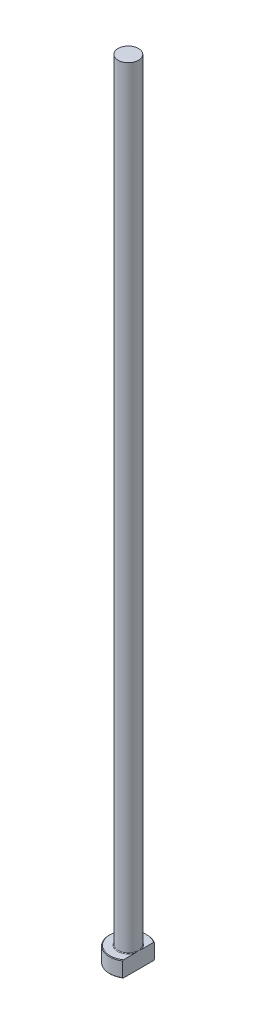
from build123d import *
from build123d.topology import SkipClean

# Parameters (mm, degrees)
CHAMFER1_SIZE = 0.2
FILLET1_R     = 0.2
KEY_DEPTH     = 251.143958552


with BuildPart() as part:
    # Sketch1 → Revolve1 (revolve)
    with BuildSketch(Plane.XY, mode=Mode.PRIVATE) as revolve1_sk:
        Polygon((0, 0), (-6, 0), (-6, 5), (-3.25, 5), (-3.25, 250), (0, 250), align=None)
    revolve(revolve1_sk.sketch.rotate(Axis((0, 259.958771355, 0), (0, -1, 0)), 270), axis=Axis((0, 259.958771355, 0), (0, -1, 0)))

    # Chamfer1
    chamfer1_edges = [part.edges().sort_by_distance(p)[0] for p in [
        (0, 5, -6),
        (0, 0, -6),
    ]]
    chamfer(chamfer1_edges, length=CHAMFER1_SIZE)

    # Fillet1
    fillet1_edges = [part.edges().sort_by_distance(p)[0] for p in [
        (0, 5, -3.25),
    ]]
    fillet(fillet1_edges, radius=FILLET1_R)

    # Sketch2 → KEY (cut, through all)
    with SkipClean():  # the faces are left unmerged after this step: merging them gives an invalid solid
        with BuildSketch(Plane(origin=(0, 0, 0), x_dir=(1, 0, 0), z_dir=(0, 1, 0))):
            with BuildLine():
                Line((3.25, 5.04356025), (3.25, -5.04356025))
                ThreePointArc((3.25, -5.04356025), (6, 0), (3.25, 5.04356025))
            make_face()
        extrude(amount=KEY_DEPTH, mode=Mode.SUBTRACT)


solid = part.part
